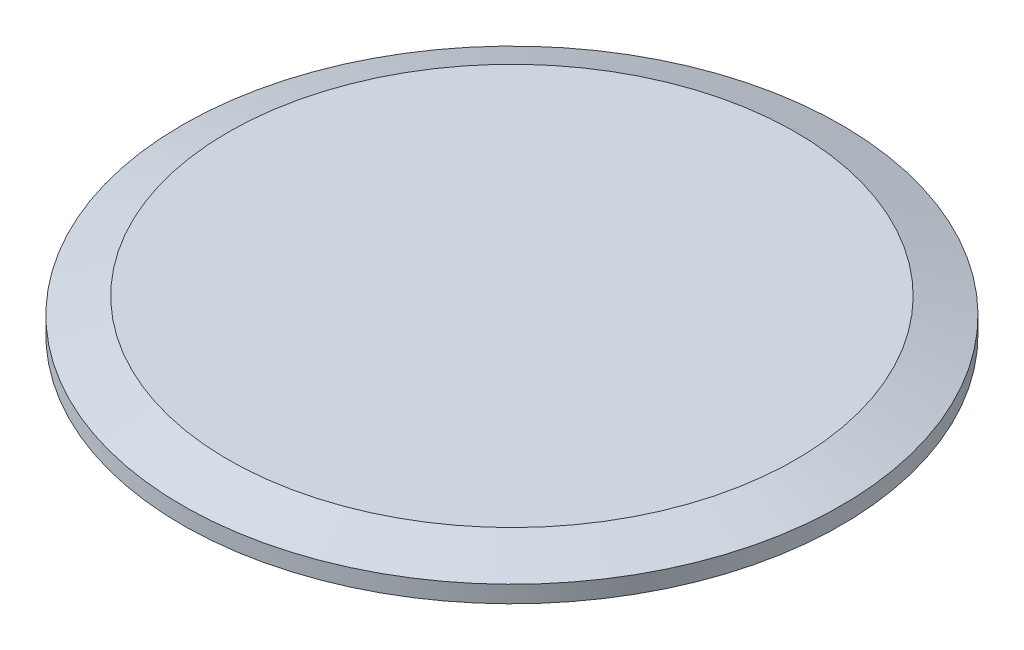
from build123d import *


with BuildPart() as part:
    # Sketch1 → Revolve1 (revolve)
    with BuildSketch(Plane.XY):
        with BuildLine():
            Line((0, 0), (-101.763191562, 0))
            ThreePointArc((-101.763191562, 0), (-102.195388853, 0.129217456), (-102.485733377, 0.474458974))
            ThreePointArc((-102.485733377, 0.474458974), (-103.5812, 1.1938), (-104.676666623, 0.474458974))
            ThreePointArc((-104.676666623, 0.474458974), (-104.967011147, 0.129217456), (-105.399208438, 0))
            Line((-105.399208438, 0), (-108.839, 0))
            Line((-108.839, 0), (-108.839, 5.588))
            Line((-108.839, 5.588), (-93.695453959, 11.0998))
            Line((-93.695453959, 11.0998), (0, 11.0998))
            Line((0, 11.0998), (0, 0))
        make_face()
    revolve(axis=Axis((0, 11.0998, 0), (0, -1, 0)))


solid = part.part
